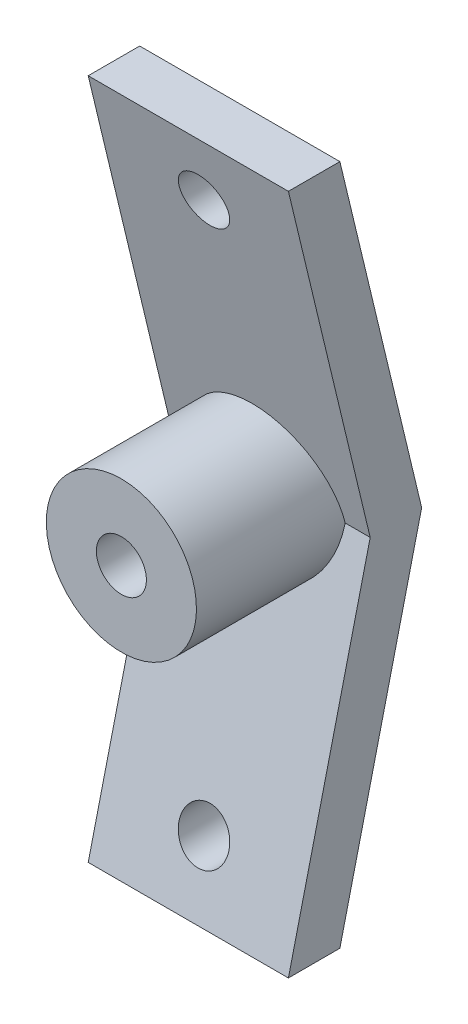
ISO-10303-21;
HEADER;
FILE_DESCRIPTION(('STEP AP214'),'2;1');
FILE_NAME('part.step','',(''),(''),'','','');
FILE_SCHEMA(('AUTOMOTIVE_DESIGN { 1 0 10303 214 1 1 1 1 }'));
ENDSEC;
DATA;
#1=APPLICATION_CONTEXT('core data for automotive mechanical design processes');
#2=APPLICATION_PROTOCOL_DEFINITION('international standard','automotive_design',2000,#1);
#3=PRODUCT_CONTEXT('',#1,'mechanical');
#4=PRODUCT('Part','Part','',(#3));
#5=PRODUCT_RELATED_PRODUCT_CATEGORY('part','',(#4));
#6=PRODUCT_DEFINITION_FORMATION('','',#4);
#7=PRODUCT_DEFINITION_CONTEXT('part definition',#1,'design');
#8=PRODUCT_DEFINITION('design','',#6,#7);
#9=PRODUCT_DEFINITION_SHAPE('','',#8);
#10=(LENGTH_UNIT() NAMED_UNIT(*) SI_UNIT(.MILLI.,.METRE.));
#11=(NAMED_UNIT(*) PLANE_ANGLE_UNIT() SI_UNIT($,.RADIAN.));
#12=(NAMED_UNIT(*) SI_UNIT($,.STERADIAN.) SOLID_ANGLE_UNIT());
#13=UNCERTAINTY_MEASURE_WITH_UNIT(LENGTH_MEASURE(1.E-05),#10,'distance_accuracy_value','');
#14=(GEOMETRIC_REPRESENTATION_CONTEXT(3) GLOBAL_UNCERTAINTY_ASSIGNED_CONTEXT((#13)) GLOBAL_UNIT_ASSIGNED_CONTEXT((#10,
#11,#12)) REPRESENTATION_CONTEXT('',''));
#15=CARTESIAN_POINT('',(0.,0.,0.));
#16=DIRECTION('',(0.,0.,1.));
#17=DIRECTION('',(1.,0.,0.));
#18=AXIS2_PLACEMENT_3D('',#15,#16,#17);
#19=CARTESIAN_POINT('',(-2.,-6.80658944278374,1.63411754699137));
#20=DIRECTION('',(0.,-0.233445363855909,-0.972369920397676));
#21=DIRECTION('',(0.,0.972369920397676,-0.233445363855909));
#22=AXIS2_PLACEMENT_3D('',#19,#20,#21);
#23=PLANE('',#22);
#24=DIRECTION('',(1.,0.,0.));
#25=VECTOR('',#24,1.);
#26=CARTESIAN_POINT('',(-2.,0.,0.));
#27=LINE('',#26,#25);
#28=CARTESIAN_POINT('',(-2.,0.,0.));
#29=VERTEX_POINT('',#28);
#30=CARTESIAN_POINT('',(2.,0.,0.));
#31=VERTEX_POINT('',#30);
#32=EDGE_CURVE('E90',#29,#31,#27,.T.);
#33=ORIENTED_EDGE('',*,*,#32,.T.);
#34=DIRECTION('',(0.,0.972369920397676,-0.233445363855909));
#35=VECTOR('',#34,1.);
#36=CARTESIAN_POINT('',(2.,-6.80658944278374,1.63411754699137));
#37=LINE('',#36,#35);
#38=CARTESIAN_POINT('',(2.,-6.80658944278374,1.63411754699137));
#39=VERTEX_POINT('',#38);
#40=EDGE_CURVE('E94',#39,#31,#37,.T.);
#41=ORIENTED_EDGE('',*,*,#40,.F.);
#42=DIRECTION('',(1.,0.,0.));
#43=VECTOR('',#42,1.);
#44=CARTESIAN_POINT('',(-2.,-6.80658944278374,1.63411754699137));
#45=LINE('',#44,#43);
#46=CARTESIAN_POINT('',(-2.,-6.80658944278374,1.63411754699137));
#47=VERTEX_POINT('',#46);
#48=EDGE_CURVE('E12',#47,#39,#45,.T.);
#49=ORIENTED_EDGE('',*,*,#48,.F.);
#50=DIRECTION('',(0.,0.972369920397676,-0.233445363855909));
#51=VECTOR('',#50,1.);
#52=CARTESIAN_POINT('',(-2.,-6.80658944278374,1.63411754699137));
#53=LINE('',#52,#51);
#54=EDGE_CURVE('E95',#47,#29,#53,.T.);
#55=ORIENTED_EDGE('',*,*,#54,.T.);
#56=EDGE_LOOP('',(#33,#41,#49,#55));
#57=FACE_BOUND('',#56,.T.);
#58=CARTESIAN_POINT('',(0.,-5.5,1.32043317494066));
#59=DIRECTION('',(0.,-0.233445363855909,-0.972369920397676));
#60=DIRECTION('',(0.,0.972369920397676,-0.233445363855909));
#61=AXIS2_PLACEMENT_3D('',#58,#59,#60);
#62=ELLIPSE('',#61,0.514207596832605,0.5);
#63=CARTESIAN_POINT('',(0.,-5.,1.2003937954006));
#64=VERTEX_POINT('',#63);
#65=EDGE_CURVE('E147',#64,#64,#62,.F.);
#66=ORIENTED_EDGE('',*,*,#65,.T.);
#67=EDGE_LOOP('',(#66));
#68=FACE_BOUND('',#67,.T.);
#69=ADVANCED_FACE('F40',(#57,#68),#23,.T.);
#70=CARTESIAN_POINT('',(-2.,0.,1.02841519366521));
#71=DIRECTION('',(0.,0.233445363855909,0.972369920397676));
#72=DIRECTION('',(0.,-0.972369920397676,0.233445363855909));
#73=AXIS2_PLACEMENT_3D('',#70,#71,#72);
#74=PLANE('',#73);
#75=DIRECTION('',(1.,0.,0.));
#76=VECTOR('',#75,1.);
#77=CARTESIAN_POINT('',(-2.,-6.80658944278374,2.66253274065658));
#78=LINE('',#77,#76);
#79=CARTESIAN_POINT('',(-2.,-6.80658944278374,2.66253274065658));
#80=VERTEX_POINT('',#79);
#81=CARTESIAN_POINT('',(2.,-6.80658944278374,2.66253274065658));
#82=VERTEX_POINT('',#81);
#83=EDGE_CURVE('E48',#80,#82,#78,.T.);
#84=ORIENTED_EDGE('',*,*,#83,.T.);
#85=DIRECTION('',(0.,-0.972369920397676,0.233445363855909));
#86=VECTOR('',#85,1.);
#87=CARTESIAN_POINT('',(2.,0.,1.02841519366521));
#88=LINE('',#87,#86);
#89=CARTESIAN_POINT('',(2.,0.,1.02841519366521));
#90=VERTEX_POINT('',#89);
#91=EDGE_CURVE('E126',#90,#82,#88,.T.);
#92=ORIENTED_EDGE('',*,*,#91,.F.);
#93=DIRECTION('',(1.,0.,0.));
#94=VECTOR('',#93,1.);
#95=CARTESIAN_POINT('',(-2.,0.,1.02841519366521));
#96=LINE('',#95,#94);
#97=CARTESIAN_POINT('',(-2.,0.,1.02841519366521));
#98=VERTEX_POINT('',#97);
#99=EDGE_CURVE('E142',#98,#90,#96,.T.);
#100=ORIENTED_EDGE('',*,*,#99,.F.);
#101=DIRECTION('',(0.,-0.972369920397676,0.233445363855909));
#102=VECTOR('',#101,1.);
#103=CARTESIAN_POINT('',(-2.,0.,1.02841519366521));
#104=LINE('',#103,#102);
#105=EDGE_CURVE('E138',#98,#80,#104,.T.);
#106=ORIENTED_EDGE('',*,*,#105,.T.);
#107=EDGE_LOOP('',(#84,#92,#100,#106));
#108=FACE_BOUND('',#107,.T.);
#109=CARTESIAN_POINT('',(0.,-5.5,2.34884836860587));
#110=DIRECTION('',(0.,0.233445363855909,0.972369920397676));
#111=DIRECTION('',(0.,0.972369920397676,-0.233445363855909));
#112=AXIS2_PLACEMENT_3D('',#109,#110,#111);
#113=ELLIPSE('',#112,0.514207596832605,0.5);
#114=CARTESIAN_POINT('',(0.,-5.,2.22880898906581));
#115=VERTEX_POINT('',#114);
#116=EDGE_CURVE('E43',#115,#115,#113,.F.);
#117=ORIENTED_EDGE('',*,*,#116,.T.);
#118=EDGE_LOOP('',(#117));
#119=FACE_BOUND('',#118,.T.);
#120=ADVANCED_FACE('F154',(#108,#119),#74,.T.);
#121=CARTESIAN_POINT('',(-2.,6.80658944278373,2.66253274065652));
#122=DIRECTION('',(0.,-0.233445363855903,0.972369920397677));
#123=DIRECTION('',(0.,-0.972369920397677,-0.233445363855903));
#124=AXIS2_PLACEMENT_3D('',#121,#122,#123);
#125=PLANE('',#124);
#126=ORIENTED_EDGE('',*,*,#99,.T.);
#127=DIRECTION('',(0.,-0.972369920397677,-0.233445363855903));
#128=VECTOR('',#127,1.);
#129=CARTESIAN_POINT('',(2.,6.80658944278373,2.66253274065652));
#130=LINE('',#129,#128);
#131=CARTESIAN_POINT('',(2.,6.80658944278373,2.66253274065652));
#132=VERTEX_POINT('',#131);
#133=EDGE_CURVE('E123',#132,#90,#130,.T.);
#134=ORIENTED_EDGE('',*,*,#133,.F.);
#135=DIRECTION('',(1.,0.,0.));
#136=VECTOR('',#135,1.);
#137=CARTESIAN_POINT('',(-2.,6.80658944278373,2.66253274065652));
#138=LINE('',#137,#136);
#139=CARTESIAN_POINT('',(-2.,6.80658944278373,2.66253274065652));
#140=VERTEX_POINT('',#139);
#141=EDGE_CURVE('E144',#140,#132,#138,.T.);
#142=ORIENTED_EDGE('',*,*,#141,.F.);
#143=DIRECTION('',(0.,-0.972369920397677,-0.233445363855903));
#144=VECTOR('',#143,1.);
#145=CARTESIAN_POINT('',(-2.,6.80658944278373,2.66253274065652));
#146=LINE('',#145,#144);
#147=EDGE_CURVE('E135',#140,#98,#146,.T.);
#148=ORIENTED_EDGE('',*,*,#147,.T.);
#149=EDGE_LOOP('',(#126,#134,#142,#148));
#150=FACE_BOUND('',#149,.T.);
#151=CARTESIAN_POINT('',(0.,5.5,2.34884836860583));
#152=DIRECTION('',(0.,-0.233445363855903,0.972369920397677));
#153=DIRECTION('',(0.,-0.972369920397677,-0.233445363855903));
#154=AXIS2_PLACEMENT_3D('',#151,#152,#153);
#155=ELLIPSE('',#154,0.514207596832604,0.5);
#156=CARTESIAN_POINT('',(0.,5.,2.22880898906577));
#157=VERTEX_POINT('',#156);
#158=EDGE_CURVE('E115',#157,#157,#155,.F.);
#159=ORIENTED_EDGE('',*,*,#158,.T.);
#160=EDGE_LOOP('',(#159));
#161=FACE_BOUND('',#160,.T.);
#162=ADVANCED_FACE('F170',(#150,#161),#125,.T.);
#163=CARTESIAN_POINT('',(-2.,0.,0.));
#164=DIRECTION('',(0.,0.233445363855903,-0.972369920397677));
#165=DIRECTION('',(0.,0.972369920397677,0.233445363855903));
#166=AXIS2_PLACEMENT_3D('',#163,#164,#165);
#167=PLANE('',#166);
#168=DIRECTION('',(1.,0.,0.));
#169=VECTOR('',#168,1.);
#170=CARTESIAN_POINT('',(-2.,6.80658944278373,1.63411754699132));
#171=LINE('',#170,#169);
#172=CARTESIAN_POINT('',(-2.,6.80658944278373,1.63411754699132));
#173=VERTEX_POINT('',#172);
#174=CARTESIAN_POINT('',(2.,6.80658944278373,1.63411754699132));
#175=VERTEX_POINT('',#174);
#176=EDGE_CURVE('E99',#173,#175,#171,.T.);
#177=ORIENTED_EDGE('',*,*,#176,.T.);
#178=DIRECTION('',(0.,0.972369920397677,0.233445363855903));
#179=VECTOR('',#178,1.);
#180=CARTESIAN_POINT('',(2.,0.,0.));
#181=LINE('',#180,#179);
#182=EDGE_CURVE('E103',#31,#175,#181,.T.);
#183=ORIENTED_EDGE('',*,*,#182,.F.);
#184=ORIENTED_EDGE('',*,*,#32,.F.);
#185=DIRECTION('',(0.,0.972369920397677,0.233445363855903));
#186=VECTOR('',#185,1.);
#187=CARTESIAN_POINT('',(-2.,0.,0.));
#188=LINE('',#187,#186);
#189=EDGE_CURVE('E130',#29,#173,#188,.T.);
#190=ORIENTED_EDGE('',*,*,#189,.T.);
#191=EDGE_LOOP('',(#177,#183,#184,#190));
#192=FACE_BOUND('',#191,.T.);
#193=CARTESIAN_POINT('',(0.,5.5,1.32043317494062));
#194=DIRECTION('',(0.,0.233445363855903,-0.972369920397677));
#195=DIRECTION('',(0.,-0.972369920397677,-0.233445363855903));
#196=AXIS2_PLACEMENT_3D('',#193,#194,#195);
#197=ELLIPSE('',#196,0.514207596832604,0.5);
#198=CARTESIAN_POINT('',(0.,5.,1.20039379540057));
#199=VERTEX_POINT('',#198);
#200=EDGE_CURVE('E118',#199,#199,#197,.F.);
#201=ORIENTED_EDGE('',*,*,#200,.T.);
#202=EDGE_LOOP('',(#201));
#203=FACE_BOUND('',#202,.T.);
#204=ADVANCED_FACE('F104',(#192,#203),#167,.T.);
#205=CARTESIAN_POINT('',(-2.,-6.80658944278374,2.66253274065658));
#206=DIRECTION('',(0.,-1.,0.));
#207=DIRECTION('',(0.,0.,-1.));
#208=AXIS2_PLACEMENT_3D('',#205,#206,#207);
#209=PLANE('',#208);
#210=ORIENTED_EDGE('',*,*,#48,.T.);
#211=DIRECTION('',(0.,0.,-1.));
#212=VECTOR('',#211,1.);
#213=CARTESIAN_POINT('',(2.,-6.80658944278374,2.66253274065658));
#214=LINE('',#213,#212);
#215=EDGE_CURVE('E114',#82,#39,#214,.T.);
#216=ORIENTED_EDGE('',*,*,#215,.F.);
#217=ORIENTED_EDGE('',*,*,#83,.F.);
#218=DIRECTION('',(0.,0.,-1.));
#219=VECTOR('',#218,1.);
#220=CARTESIAN_POINT('',(-2.,-6.80658944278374,2.66253274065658));
#221=LINE('',#220,#219);
#222=EDGE_CURVE('E100',#80,#47,#221,.T.);
#223=ORIENTED_EDGE('',*,*,#222,.T.);
#224=EDGE_LOOP('',(#210,#216,#217,#223));
#225=FACE_BOUND('',#224,.T.);
#226=ADVANCED_FACE('F179',(#225),#209,.T.);
#227=CARTESIAN_POINT('',(-2.,6.80658944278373,1.63411754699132));
#228=DIRECTION('',(0.,1.,0.));
#229=DIRECTION('',(0.,0.,1.));
#230=AXIS2_PLACEMENT_3D('',#227,#228,#229);
#231=PLANE('',#230);
#232=ORIENTED_EDGE('',*,*,#141,.T.);
#233=DIRECTION('',(0.,0.,1.));
#234=VECTOR('',#233,1.);
#235=CARTESIAN_POINT('',(2.,6.80658944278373,1.63411754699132));
#236=LINE('',#235,#234);
#237=EDGE_CURVE('E109',#175,#132,#236,.T.);
#238=ORIENTED_EDGE('',*,*,#237,.F.);
#239=ORIENTED_EDGE('',*,*,#176,.F.);
#240=DIRECTION('',(0.,0.,1.));
#241=VECTOR('',#240,1.);
#242=CARTESIAN_POINT('',(-2.,6.80658944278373,1.63411754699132));
#243=LINE('',#242,#241);
#244=EDGE_CURVE('E132',#173,#140,#243,.T.);
#245=ORIENTED_EDGE('',*,*,#244,.T.);
#246=EDGE_LOOP('',(#232,#238,#239,#245));
#247=FACE_BOUND('',#246,.T.);
#248=ADVANCED_FACE('F182',(#247),#231,.T.);
#249=CARTESIAN_POINT('',(-2.,6.80658944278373,-1.63411754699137));
#250=DIRECTION('',(1.,0.,0.));
#251=DIRECTION('',(0.,0.,-1.));
#252=AXIS2_PLACEMENT_3D('',#249,#250,#251);
#253=PLANE('',#252);
#254=ORIENTED_EDGE('',*,*,#54,.F.);
#255=ORIENTED_EDGE('',*,*,#222,.F.);
#256=ORIENTED_EDGE('',*,*,#105,.F.);
#257=ORIENTED_EDGE('',*,*,#147,.F.);
#258=ORIENTED_EDGE('',*,*,#244,.F.);
#259=ORIENTED_EDGE('',*,*,#189,.F.);
#260=EDGE_LOOP('',(#254,#255,#256,#257,#258,#259));
#261=FACE_BOUND('',#260,.T.);
#262=ADVANCED_FACE('F184',(#261),#253,.F.);
#263=CARTESIAN_POINT('',(2.,6.80658944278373,-1.63411754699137));
#264=DIRECTION('',(1.,0.,0.));
#265=DIRECTION('',(0.,0.,-1.));
#266=AXIS2_PLACEMENT_3D('',#263,#264,#265);
#267=PLANE('',#266);
#268=ORIENTED_EDGE('',*,*,#40,.T.);
#269=ORIENTED_EDGE('',*,*,#182,.T.);
#270=ORIENTED_EDGE('',*,*,#237,.T.);
#271=ORIENTED_EDGE('',*,*,#133,.T.);
#272=ORIENTED_EDGE('',*,*,#91,.T.);
#273=ORIENTED_EDGE('',*,*,#215,.T.);
#274=EDGE_LOOP('',(#268,#269,#270,#271,#272,#273));
#275=FACE_BOUND('',#274,.T.);
#276=ADVANCED_FACE('F112',(#275),#267,.T.);
#277=CARTESIAN_POINT('',(0.,5.5,10.));
#278=DIRECTION('',(0.,0.,-1.));
#279=DIRECTION('',(-1.,0.,0.));
#280=AXIS2_PLACEMENT_3D('',#277,#278,#279);
#281=CYLINDRICAL_SURFACE('',#280,0.5);
#282=ORIENTED_EDGE('',*,*,#158,.F.);
#283=EDGE_LOOP('',(#282));
#284=FACE_BOUND('',#283,.T.);
#285=ORIENTED_EDGE('',*,*,#200,.F.);
#286=EDGE_LOOP('',(#285));
#287=FACE_BOUND('',#286,.T.);
#288=ADVANCED_FACE('F158',(#284,#287),#281,.F.);
#289=CARTESIAN_POINT('',(0.,-5.5,10.));
#290=DIRECTION('',(0.,0.,-1.));
#291=DIRECTION('',(-1.,0.,0.));
#292=AXIS2_PLACEMENT_3D('',#289,#290,#291);
#293=CYLINDRICAL_SURFACE('',#292,0.5);
#294=ORIENTED_EDGE('',*,*,#65,.F.);
#295=EDGE_LOOP('',(#294));
#296=FACE_BOUND('',#295,.T.);
#297=ORIENTED_EDGE('',*,*,#116,.F.);
#298=EDGE_LOOP('',(#297));
#299=FACE_BOUND('',#298,.T.);
#300=ADVANCED_FACE('F156',(#296,#299),#293,.F.);
#301=CLOSED_SHELL('',(#69,#120,#162,#204,#226,#248,#262,#276,#288,#300));
#302=MANIFOLD_SOLID_BREP('B2',#301);
#303=CARTESIAN_POINT('',(0.,0.,2.));
#304=DIRECTION('',(0.,0.,1.));
#305=DIRECTION('',(0.,-1.,0.));
#306=AXIS2_PLACEMENT_3D('',#303,#304,#305);
#307=PLANE('',#306);
#308=CARTESIAN_POINT('',(0.,0.,2.));
#309=DIRECTION('',(0.,0.,-1.));
#310=DIRECTION('',(0.,1.,0.));
#311=AXIS2_PLACEMENT_3D('',#308,#309,#310);
#312=CIRCLE('',#311,0.5);
#313=CARTESIAN_POINT('',(0.,0.49999999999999,2.));
#314=VERTEX_POINT('',#313);
#315=EDGE_CURVE('E290',#314,#314,#312,.T.);
#316=ORIENTED_EDGE('',*,*,#315,.F.);
#317=EDGE_LOOP('',(#316));
#318=FACE_BOUND('',#317,.T.);
#319=ADVANCED_FACE('F257',(#318),#307,.T.);
#320=CARTESIAN_POINT('',(0.,0.,0.));
#321=DIRECTION('',(0.,0.,1.));
#322=DIRECTION('',(0.,-1.,0.));
#323=AXIS2_PLACEMENT_3D('',#320,#321,#322);
#324=CONICAL_SURFACE('',#323,0.,1.33517687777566);
#325=CARTESIAN_POINT('',(0.,0.,0.360118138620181));
#326=DIRECTION('',(0.,0.,-1.));
#327=DIRECTION('',(0.,1.,0.));
#328=AXIS2_PLACEMENT_3D('',#325,#326,#327);
#329=CIRCLE('',#328,1.50000000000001);
#330=CARTESIAN_POINT('',(0.,1.5,0.360118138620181));
#331=VERTEX_POINT('',#330);
#332=EDGE_CURVE('E38',#331,#331,#329,.T.);
#333=ORIENTED_EDGE('',*,*,#332,.T.);
#334=EDGE_LOOP('',(#333));
#335=FACE_BOUND('',#334,.T.);
#336=CARTESIAN_POINT('',(0.,0.,0.));
#337=VERTEX_POINT('',#336);
#338=VERTEX_LOOP('',#337);
#339=FACE_BOUND('',#338,.T.);
#340=ADVANCED_FACE('F266',(#335,#339),#324,.T.);
#341=CARTESIAN_POINT('',(0.,0.,0.));
#342=DIRECTION('',(0.,0.,-1.));
#343=DIRECTION('',(0.,1.,0.));
#344=AXIS2_PLACEMENT_3D('',#341,#342,#343);
#345=CYLINDRICAL_SURFACE('',#344,1.50000000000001);
#346=CARTESIAN_POINT('',(0.,0.,4.));
#347=DIRECTION('',(0.,0.,-1.));
#348=DIRECTION('',(0.,1.,0.));
#349=AXIS2_PLACEMENT_3D('',#346,#347,#348);
#350=CIRCLE('',#349,1.50000000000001);
#351=CARTESIAN_POINT('',(0.,1.5,4.));
#352=VERTEX_POINT('',#351);
#353=EDGE_CURVE('E263',#352,#352,#350,.T.);
#354=ORIENTED_EDGE('',*,*,#353,.T.);
#355=EDGE_LOOP('',(#354));
#356=FACE_BOUND('',#355,.T.);
#357=ORIENTED_EDGE('',*,*,#332,.F.);
#358=EDGE_LOOP('',(#357));
#359=FACE_BOUND('',#358,.T.);
#360=ADVANCED_FACE('F268',(#356,#359),#345,.T.);
#361=CARTESIAN_POINT('',(0.,0.49999999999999,4.));
#362=DIRECTION('',(0.,0.,1.));
#363=DIRECTION('',(0.,-1.,0.));
#364=AXIS2_PLACEMENT_3D('',#361,#362,#363);
#365=PLANE('',#364);
#366=CARTESIAN_POINT('',(0.,0.,4.));
#367=DIRECTION('',(0.,0.,-1.));
#368=DIRECTION('',(0.,1.,0.));
#369=AXIS2_PLACEMENT_3D('',#366,#367,#368);
#370=CIRCLE('',#369,0.5);
#371=CARTESIAN_POINT('',(0.,0.49999999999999,4.));
#372=VERTEX_POINT('',#371);
#373=EDGE_CURVE('E293',#372,#372,#370,.T.);
#374=ORIENTED_EDGE('',*,*,#373,.T.);
#375=EDGE_LOOP('',(#374));
#376=FACE_BOUND('',#375,.T.);
#377=ORIENTED_EDGE('',*,*,#353,.F.);
#378=EDGE_LOOP('',(#377));
#379=FACE_BOUND('',#378,.T.);
#380=ADVANCED_FACE('F274',(#376,#379),#365,.T.);
#381=CARTESIAN_POINT('',(0.,0.,0.));
#382=DIRECTION('',(0.,0.,-1.));
#383=DIRECTION('',(0.,1.,0.));
#384=AXIS2_PLACEMENT_3D('',#381,#382,#383);
#385=CYLINDRICAL_SURFACE('',#384,0.5);
#386=ORIENTED_EDGE('',*,*,#315,.T.);
#387=EDGE_LOOP('',(#386));
#388=FACE_BOUND('',#387,.T.);
#389=ORIENTED_EDGE('',*,*,#373,.F.);
#390=EDGE_LOOP('',(#389));
#391=FACE_BOUND('',#390,.T.);
#392=ADVANCED_FACE('F281',(#388,#391),#385,.F.);
#393=CLOSED_SHELL('',(#319,#340,#360,#380,#392));
#394=MANIFOLD_SOLID_BREP('B6',#393);
#395=ADVANCED_BREP_SHAPE_REPRESENTATION('',(#18,#302,#394),#14);
#396=SHAPE_DEFINITION_REPRESENTATION(#9,#395);
ENDSEC;
END-ISO-10303-21;
